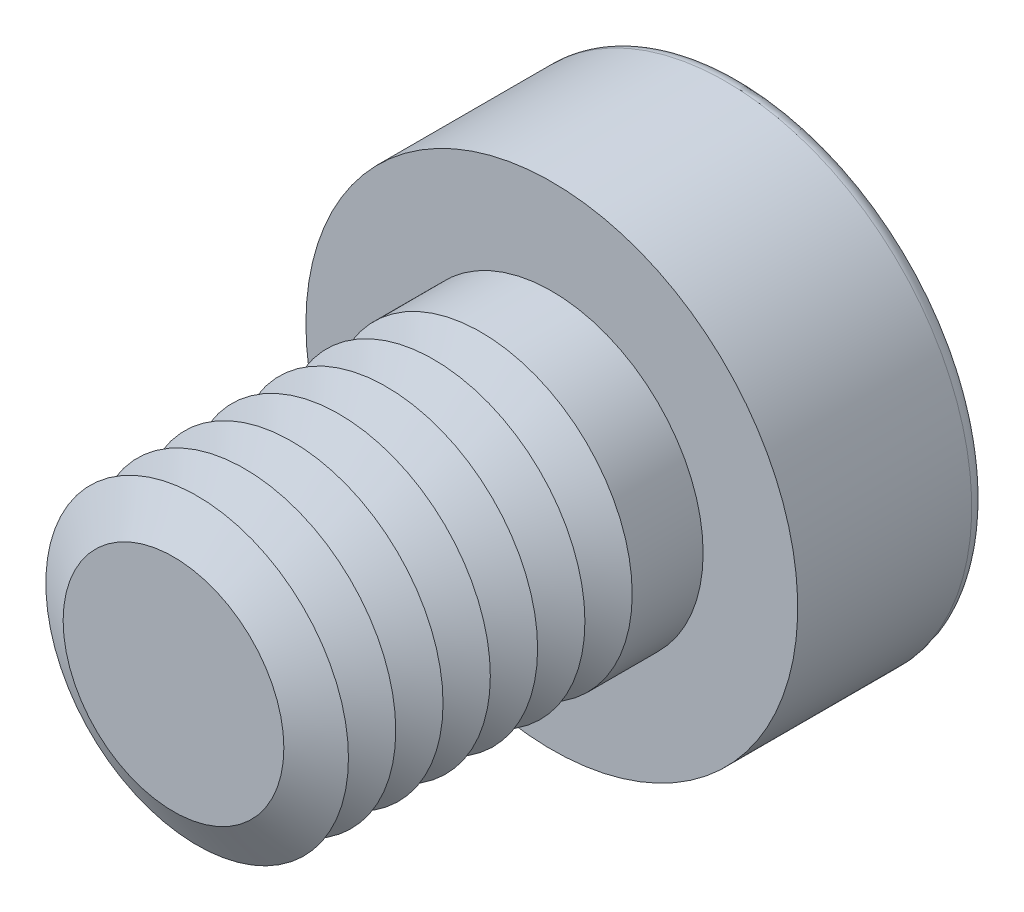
from build123d import *

# Parameters (mm, degrees)
SKETCH1_R           = 4
BOSS_EXTRUDE1_DEPTH = 10
SKETCH2_R           = 6.5
BOSS_EXTRUDE2_DEPTH = 5
CUT_EXTRUDE1_DEPTH  = 3.75
FILLET1_R           = 0.4
LPATTERN1_COUNT     = 7
LPATTERN1_PITCH     = 1.25


with BuildPart() as part:
    # Sketch1 → Boss-Extrude1 (new body)
    with BuildSketch(Plane.XY):
        Circle(SKETCH1_R)
    extrude(amount=BOSS_EXTRUDE1_DEPTH)

    # Sketch2 → Boss-Extrude2 (add)
    with BuildSketch(Plane(origin=(0, 0, 0), x_dir=(-1, 0, 0), z_dir=(0, 0, -1))):
        Circle(SKETCH2_R)
    extrude(amount=BOSS_EXTRUDE2_DEPTH)

    # Sketch3 → Cut-Extrude1 (cut)
    with BuildSketch(Plane(origin=(0, 0, -5), x_dir=(-1, 0, 0), z_dir=(0, 0, -1))):
        Polygon((-1.443375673, 2.5), (-2.886751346, 0), (-1.443375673, -2.5), (1.443375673, -2.5), (2.886751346, 0), (1.443375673, 2.5), align=None)
    extrude(amount=-CUT_EXTRUDE1_DEPTH, mode=Mode.SUBTRACT)

    # Fillet1
    fillet1_edges = [part.edges().sort_by_distance(p)[0] for p in [
        (6.5, 0, -5),
    ]]
    fillet(fillet1_edges, radius=FILLET1_R)

    # Cut-Extrude2 cone 1 section (on through the dimple's axis) → Cut-Extrude2 (revolve, cut)
    with BuildSketch(Plane(origin=(0, 0, -1.25), x_dir=(0, 1, 0), z_dir=(1, 0, 0))):
        Polygon((0, 0), (2.5, 0), (0, 1.443375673), align=None)
    revolve(axis=Axis((0, 0, -1.25), (0, 0, 1)), mode=Mode.SUBTRACT)

    # Cut-Extrude3 cone 1 section (on through the dimple's axis) → Cut-Extrude3 (revolve, cut)
    with BuildSketch(Plane(origin=(0, 0, -5), x_dir=(0, 1, 0), z_dir=(1, 0, 0))):
        Polygon((0, 0), (2.886751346, 0), (0, 0.773502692), align=None)
    revolve(axis=Axis((0, 0, -5), (0, 0, 1)), mode=Mode.SUBTRACT)

    # Sketch7 → Cut-Revolve1 (revolve, cut)
    with BuildSketch(Plane(origin=(0, 0, 0), x_dir=(0, 0, -1), z_dir=(1, 0, 0)), mode=Mode.PRIVATE) as cut_revolve1_sk:
        Polygon((-10, 2.917468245), (-9.375, 4), (-10.625, 4), align=None)
    cut_revolve1 = revolve(cut_revolve1_sk.sketch.rotate(Axis((0, 0, 10), (0, 0, -1)), 90), axis=Axis((0, 0, 10), (0, 0, -1)), mode=Mode.SUBTRACT)

    # LPattern1: Cut-Revolve1 ×7
    with Locations(*[(0, 0, -i * LPATTERN1_PITCH) for i in range(1, LPATTERN1_COUNT)]):
        add(cut_revolve1, mode=Mode.SUBTRACT)


solid = part.part
